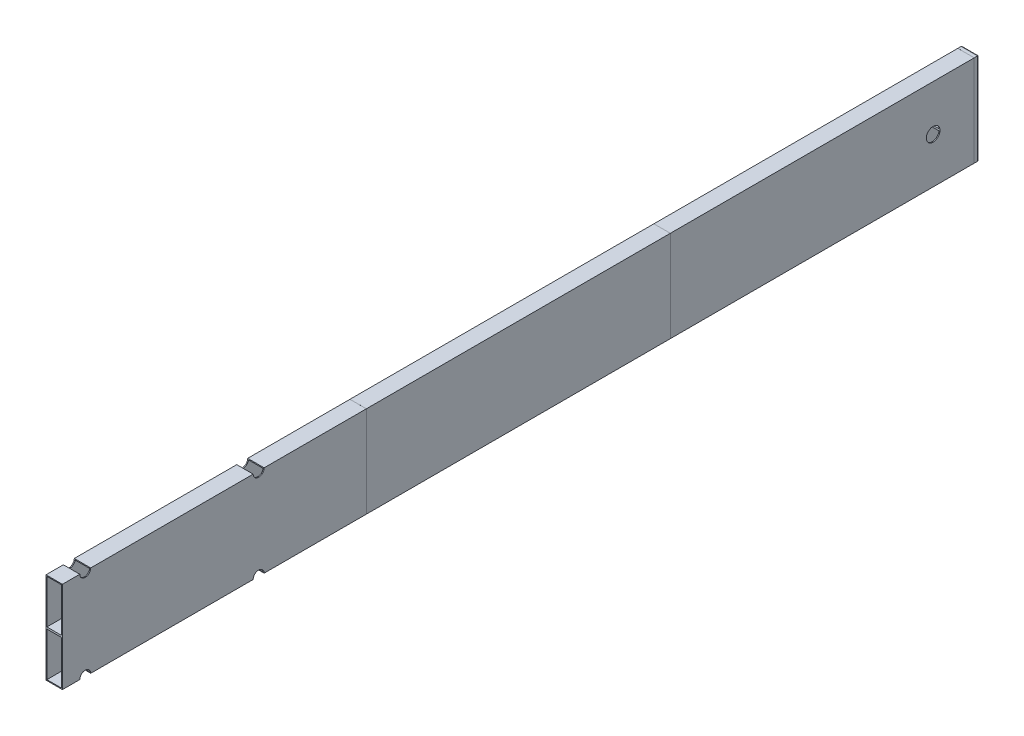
from build123d import *

# Parameters (mm, degrees)
ESQUISSE1_W             = 18
ESQUISSE1_H             = 100
ESQUISSE1_W_2           = 16
ESQUISSE1_H_2           = 48
BASE_EXTRUSION_DEPTH    = 333
ESQUISSE4_R             = 6
ENL_V_MAT_EXTRU_1_DEPTH = 349.156573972
ESQUISSE7_W             = 18.02
ESQUISSE7_H             = 100.02
ESQUISSE7_W_2           = 16
ESQUISSE7_H_2           = 48
BOSS_EXTRU_1_DEPTH      = 333
ESQUISSE8_W             = 18
ESQUISSE8_H             = 100
ESQUISSE8_W_2           = 16
ESQUISSE8_H_2           = 48
BOSS_EXTRU_2_DEPTH      = 333
ESQUISSE9_W             = 18.02
ESQUISSE9_H             = 100.02
BOSS_EXTRU_3_DEPTH      = 5
CONG_1_R                = 1.5
ESQUISSE11_R            = 7.5
ENL_V_MAT_EXTRU_2_DEPTH = 1010.129506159


with BuildPart() as part:
    # Esquisse1 → Base-Extrusion (new body)
    with BuildSketch(Plane.XY):
        with Locations((0, 50)):
            Rectangle(ESQUISSE1_W, ESQUISSE1_H)
        with Locations((0, 25)):
            Rectangle(ESQUISSE1_W_2, ESQUISSE1_H_2, mode=Mode.SUBTRACT)
        with Locations((0, 75)):
            Rectangle(ESQUISSE1_W_2, ESQUISSE1_H_2, mode=Mode.SUBTRACT)
    extrude(amount=-BASE_EXTRUSION_DEPTH)

    # Esquisse4 → Enl_v. mat.-Extru.1 (cut, through all)
    with BuildSketch(Plane(origin=(9, 0, 0), x_dir=(0, 0, -1), z_dir=(1, 0, 0))):
        with Locations((25, 100)):
            Circle(ESQUISSE4_R)
        with Locations((215, 100)):
            Circle(ESQUISSE4_R)
        with Locations((25, 0)):
            Circle(ESQUISSE4_R)
        with Locations((215, 0)):
            Circle(ESQUISSE4_R)
    extrude(amount=-ENL_V_MAT_EXTRU_1_DEPTH, mode=Mode.SUBTRACT)

    # Esquisse7 → Boss.-Extru.1 (add)
    with BuildSketch(Plane(origin=(0, 0, -333), x_dir=(-1, 0, 0), z_dir=(0, 0, -1))):
        with Locations((0, 50)):
            Rectangle(ESQUISSE7_W, ESQUISSE7_H)
        with Locations((0, 25)):
            Rectangle(ESQUISSE7_W_2, ESQUISSE7_H_2, mode=Mode.SUBTRACT)
        with Locations((0, 75)):
            Rectangle(ESQUISSE7_W_2, ESQUISSE7_H_2, mode=Mode.SUBTRACT)
    extrude(amount=BOSS_EXTRU_1_DEPTH)

    # Esquisse8 → Boss.-Extru.2 (add)
    with BuildSketch(Plane(origin=(0, 0, -666), x_dir=(-1, 0, 0), z_dir=(0, 0, -1))):
        with Locations((0, 50)):
            Rectangle(ESQUISSE8_W, ESQUISSE8_H)
        with Locations((0, 25)):
            Rectangle(ESQUISSE8_W_2, ESQUISSE8_H_2, mode=Mode.SUBTRACT)
        with Locations((0, 75)):
            Rectangle(ESQUISSE8_W_2, ESQUISSE8_H_2, mode=Mode.SUBTRACT)
    extrude(amount=BOSS_EXTRU_2_DEPTH)

    # Esquisse9 → Boss.-Extru.3 (add)
    with BuildSketch(Plane(origin=(0, 0, -999), x_dir=(-1, 0, 0), z_dir=(0, 0, -1))):
        with Locations((0, 50)):
            Rectangle(ESQUISSE9_W, ESQUISSE9_H)
    extrude(amount=BOSS_EXTRU_3_DEPTH)

    # Cong_1
    cong_1_edges = [part.edges().sort_by_distance(p)[0] for p in [
        (0, 100.01, -1004),
        (9.01, 50, -1004),
        (-9.01, 50, -1004),
        (0, -0.01, -1004),
    ]]
    fillet(cong_1_edges, radius=CONG_1_R)

    # Esquisse11 → Enl_v. mat.-Extru.2 (cut, through all)
    with BuildSketch(Plane(origin=(9, 0, 0), x_dir=(0, 0, -1), z_dir=(1, 0, 0))):
        with Locations((954, 50)):
            Circle(ESQUISSE11_R)
    extrude(amount=-ENL_V_MAT_EXTRU_2_DEPTH, mode=Mode.SUBTRACT)


solid = part.part
